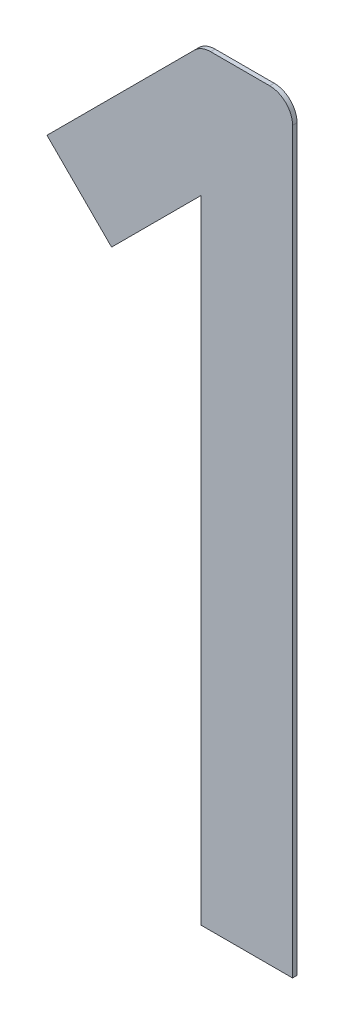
ISO-10303-21;
HEADER;
FILE_DESCRIPTION(('STEP AP214'),'2;1');
FILE_NAME('part.step','',(''),(''),'','','');
FILE_SCHEMA(('AUTOMOTIVE_DESIGN { 1 0 10303 214 1 1 1 1 }'));
ENDSEC;
DATA;
#1=APPLICATION_CONTEXT('core data for automotive mechanical design processes');
#2=APPLICATION_PROTOCOL_DEFINITION('international standard','automotive_design',2000,#1);
#3=PRODUCT_CONTEXT('',#1,'mechanical');
#4=PRODUCT('Part','Part','',(#3));
#5=PRODUCT_RELATED_PRODUCT_CATEGORY('part','',(#4));
#6=PRODUCT_DEFINITION_FORMATION('','',#4);
#7=PRODUCT_DEFINITION_CONTEXT('part definition',#1,'design');
#8=PRODUCT_DEFINITION('design','',#6,#7);
#9=PRODUCT_DEFINITION_SHAPE('','',#8);
#10=(LENGTH_UNIT() NAMED_UNIT(*) SI_UNIT(.MILLI.,.METRE.));
#11=(NAMED_UNIT(*) PLANE_ANGLE_UNIT() SI_UNIT($,.RADIAN.));
#12=(NAMED_UNIT(*) SI_UNIT($,.STERADIAN.) SOLID_ANGLE_UNIT());
#13=UNCERTAINTY_MEASURE_WITH_UNIT(LENGTH_MEASURE(1.E-05),#10,'distance_accuracy_value','');
#14=(GEOMETRIC_REPRESENTATION_CONTEXT(3) GLOBAL_UNCERTAINTY_ASSIGNED_CONTEXT((#13)) GLOBAL_UNIT_ASSIGNED_CONTEXT((#10,
#11,#12)) REPRESENTATION_CONTEXT('',''));
#15=CARTESIAN_POINT('',(0.,0.,0.));
#16=DIRECTION('',(0.,0.,1.));
#17=DIRECTION('',(1.,0.,0.));
#18=AXIS2_PLACEMENT_3D('',#15,#16,#17);
#19=CARTESIAN_POINT('',(-3.02146574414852,12.1135385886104,0.1));
#20=DIRECTION('',(-0.707106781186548,-0.707106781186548,0.));
#21=DIRECTION('',(0.707106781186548,-0.707106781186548,0.));
#22=AXIS2_PLACEMENT_3D('',#19,#20,#21);
#23=PLANE('',#22);
#24=DIRECTION('',(-0.707106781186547,0.707106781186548,0.));
#25=VECTOR('',#24,1.);
#26=CARTESIAN_POINT('',(-3.02146574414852,12.1135385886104,0.));
#27=LINE('',#26,#25);
#28=CARTESIAN_POINT('',(-3.02146574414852,12.1135385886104,0.));
#29=VERTEX_POINT('',#28);
#30=CARTESIAN_POINT('',(-4.46396357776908,13.5560364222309,0.));
#31=VERTEX_POINT('',#30);
#32=EDGE_CURVE('E109',#29,#31,#27,.T.);
#33=ORIENTED_EDGE('',*,*,#32,.F.);
#34=DIRECTION('',(0.,0.,-1.));
#35=VECTOR('',#34,1.);
#36=CARTESIAN_POINT('',(-3.02146574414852,12.1135385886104,0.1));
#37=LINE('',#36,#35);
#38=CARTESIAN_POINT('',(-3.02146574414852,12.1135385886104,0.1));
#39=VERTEX_POINT('',#38);
#40=EDGE_CURVE('E9',#39,#29,#37,.T.);
#41=ORIENTED_EDGE('',*,*,#40,.F.);
#42=DIRECTION('',(-0.707106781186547,0.707106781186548,0.));
#43=VECTOR('',#42,1.);
#44=CARTESIAN_POINT('',(-3.02146574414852,12.1135385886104,0.1));
#45=LINE('',#44,#43);
#46=CARTESIAN_POINT('',(-4.46396357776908,13.5560364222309,0.1));
#47=VERTEX_POINT('',#46);
#48=EDGE_CURVE('E110',#39,#47,#45,.T.);
#49=ORIENTED_EDGE('',*,*,#48,.T.);
#50=DIRECTION('',(0.,0.,-1.));
#51=VECTOR('',#50,1.);
#52=CARTESIAN_POINT('',(-4.46396357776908,13.5560364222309,0.1));
#53=LINE('',#52,#51);
#54=EDGE_CURVE('E17',#47,#31,#53,.T.);
#55=ORIENTED_EDGE('',*,*,#54,.T.);
#56=EDGE_LOOP('',(#33,#41,#49,#55));
#57=FACE_BOUND('',#56,.T.);
#58=ADVANCED_FACE('F14',(#57),#23,.T.);
#59=CARTESIAN_POINT('',(-3.02146574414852,12.1135385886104,0.1));
#60=DIRECTION('',(-0.707106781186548,0.707106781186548,0.));
#61=DIRECTION('',(-0.707106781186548,-0.707106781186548,0.));
#62=AXIS2_PLACEMENT_3D('',#59,#60,#61);
#63=PLANE('',#62);
#64=DIRECTION('',(0.707106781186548,0.707106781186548,0.));
#65=VECTOR('',#64,1.);
#66=CARTESIAN_POINT('',(-3.02146574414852,12.1135385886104,0.));
#67=LINE('',#66,#65);
#68=CARTESIAN_POINT('',(-1.02,14.1150043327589,0.));
#69=VERTEX_POINT('',#68);
#70=EDGE_CURVE('E130',#29,#69,#67,.T.);
#71=ORIENTED_EDGE('',*,*,#70,.T.);
#72=DIRECTION('',(0.,0.,-1.));
#73=VECTOR('',#72,1.);
#74=CARTESIAN_POINT('',(-1.02,14.1150043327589,0.1));
#75=LINE('',#74,#73);
#76=CARTESIAN_POINT('',(-1.02,14.1150043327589,0.1));
#77=VERTEX_POINT('',#76);
#78=EDGE_CURVE('E23',#77,#69,#75,.T.);
#79=ORIENTED_EDGE('',*,*,#78,.F.);
#80=DIRECTION('',(0.707106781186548,0.707106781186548,0.));
#81=VECTOR('',#80,1.);
#82=CARTESIAN_POINT('',(-3.02146574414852,12.1135385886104,0.1));
#83=LINE('',#82,#81);
#84=EDGE_CURVE('E45',#39,#77,#83,.T.);
#85=ORIENTED_EDGE('',*,*,#84,.F.);
#86=ORIENTED_EDGE('',*,*,#40,.T.);
#87=EDGE_LOOP('',(#71,#79,#85,#86));
#88=FACE_BOUND('',#87,.T.);
#89=ADVANCED_FACE('F222',(#88),#63,.F.);
#90=CARTESIAN_POINT('',(-1.02,0.,0.1));
#91=DIRECTION('',(-1.,0.,0.));
#92=DIRECTION('',(0.,-1.,0.));
#93=AXIS2_PLACEMENT_3D('',#90,#91,#92);
#94=PLANE('',#93);
#95=DIRECTION('',(0.,1.,0.));
#96=VECTOR('',#95,1.);
#97=CARTESIAN_POINT('',(-1.02,0.,0.));
#98=LINE('',#97,#96);
#99=CARTESIAN_POINT('',(-1.02,0.,0.));
#100=VERTEX_POINT('',#99);
#101=EDGE_CURVE('E317',#100,#69,#98,.T.);
#102=ORIENTED_EDGE('',*,*,#101,.F.);
#103=DIRECTION('',(0.,0.,-1.));
#104=VECTOR('',#103,1.);
#105=CARTESIAN_POINT('',(-1.02,0.,0.1));
#106=LINE('',#105,#104);
#107=CARTESIAN_POINT('',(-1.02,0.,0.1));
#108=VERTEX_POINT('',#107);
#109=EDGE_CURVE('E166',#108,#100,#106,.T.);
#110=ORIENTED_EDGE('',*,*,#109,.F.);
#111=DIRECTION('',(0.,1.,0.));
#112=VECTOR('',#111,1.);
#113=CARTESIAN_POINT('',(-1.02,0.,0.1));
#114=LINE('',#113,#112);
#115=EDGE_CURVE('E157',#108,#77,#114,.T.);
#116=ORIENTED_EDGE('',*,*,#115,.T.);
#117=ORIENTED_EDGE('',*,*,#78,.T.);
#118=EDGE_LOOP('',(#102,#110,#116,#117));
#119=FACE_BOUND('',#118,.T.);
#120=ADVANCED_FACE('F230',(#119),#94,.T.);
#121=CARTESIAN_POINT('',(-1.02,0.,0.1));
#122=DIRECTION('',(0.,1.,0.));
#123=DIRECTION('',(0.,0.,1.));
#124=AXIS2_PLACEMENT_3D('',#121,#122,#123);
#125=PLANE('',#124);
#126=DIRECTION('',(1.,0.,0.));
#127=VECTOR('',#126,1.);
#128=CARTESIAN_POINT('',(-1.02,0.,0.));
#129=LINE('',#128,#127);
#130=CARTESIAN_POINT('',(1.02,0.,0.));
#131=VERTEX_POINT('',#130);
#132=EDGE_CURVE('E316',#100,#131,#129,.T.);
#133=ORIENTED_EDGE('',*,*,#132,.T.);
#134=DIRECTION('',(0.,0.,-1.));
#135=VECTOR('',#134,1.);
#136=CARTESIAN_POINT('',(1.02,0.,0.1));
#137=LINE('',#136,#135);
#138=CARTESIAN_POINT('',(1.02,0.,0.1));
#139=VERTEX_POINT('',#138);
#140=EDGE_CURVE('E169',#139,#131,#137,.T.);
#141=ORIENTED_EDGE('',*,*,#140,.F.);
#142=DIRECTION('',(1.,0.,0.));
#143=VECTOR('',#142,1.);
#144=CARTESIAN_POINT('',(-1.02,0.,0.1));
#145=LINE('',#144,#143);
#146=EDGE_CURVE('E154',#108,#139,#145,.T.);
#147=ORIENTED_EDGE('',*,*,#146,.F.);
#148=ORIENTED_EDGE('',*,*,#109,.T.);
#149=EDGE_LOOP('',(#133,#141,#147,#148));
#150=FACE_BOUND('',#149,.T.);
#151=ADVANCED_FACE('F241',(#150),#125,.F.);
#152=CARTESIAN_POINT('',(1.02,0.,0.1));
#153=DIRECTION('',(-1.,0.,0.));
#154=DIRECTION('',(0.,-1.,0.));
#155=AXIS2_PLACEMENT_3D('',#152,#153,#154);
#156=PLANE('',#155);
#157=DIRECTION('',(0.,1.,0.));
#158=VECTOR('',#157,1.);
#159=CARTESIAN_POINT('',(1.02,0.,0.));
#160=LINE('',#159,#158);
#161=CARTESIAN_POINT('',(1.02,16.49,0.));
#162=VERTEX_POINT('',#161);
#163=EDGE_CURVE('E314',#131,#162,#160,.T.);
#164=ORIENTED_EDGE('',*,*,#163,.T.);
#165=DIRECTION('',(0.,0.,-1.));
#166=VECTOR('',#165,1.);
#167=CARTESIAN_POINT('',(1.02,16.49,0.1));
#168=LINE('',#167,#166);
#169=CARTESIAN_POINT('',(1.02,16.49,0.1));
#170=VERTEX_POINT('',#169);
#171=EDGE_CURVE('E173',#170,#162,#168,.T.);
#172=ORIENTED_EDGE('',*,*,#171,.F.);
#173=DIRECTION('',(0.,1.,0.));
#174=VECTOR('',#173,1.);
#175=CARTESIAN_POINT('',(1.02,0.,0.1));
#176=LINE('',#175,#174);
#177=EDGE_CURVE('E151',#139,#170,#176,.T.);
#178=ORIENTED_EDGE('',*,*,#177,.F.);
#179=ORIENTED_EDGE('',*,*,#140,.T.);
#180=EDGE_LOOP('',(#164,#172,#178,#179));
#181=FACE_BOUND('',#180,.T.);
#182=ADVANCED_FACE('F252',(#181),#156,.F.);
#183=CARTESIAN_POINT('',(0.51,16.49,0.1));
#184=DIRECTION('',(0.,0.,-1.));
#185=DIRECTION('',(-1.,0.,0.));
#186=AXIS2_PLACEMENT_3D('',#183,#184,#185);
#187=CYLINDRICAL_SURFACE('',#186,0.51);
#188=CARTESIAN_POINT('',(0.51,16.49,0.));
#189=DIRECTION('',(0.,0.,1.));
#190=DIRECTION('',(1.,0.,0.));
#191=AXIS2_PLACEMENT_3D('',#188,#189,#190);
#192=CIRCLE('',#191,0.51);
#193=CARTESIAN_POINT('',(0.51,17.,0.));
#194=VERTEX_POINT('',#193);
#195=EDGE_CURVE('E309',#162,#194,#192,.T.);
#196=ORIENTED_EDGE('',*,*,#195,.T.);
#197=DIRECTION('',(0.,0.,-1.));
#198=VECTOR('',#197,1.);
#199=CARTESIAN_POINT('',(0.51,17.,0.1));
#200=LINE('',#199,#198);
#201=CARTESIAN_POINT('',(0.51,17.,0.1));
#202=VERTEX_POINT('',#201);
#203=EDGE_CURVE('E177',#202,#194,#200,.T.);
#204=ORIENTED_EDGE('',*,*,#203,.F.);
#205=CARTESIAN_POINT('',(0.51,16.49,0.1));
#206=DIRECTION('',(0.,0.,1.));
#207=DIRECTION('',(1.,0.,0.));
#208=AXIS2_PLACEMENT_3D('',#205,#206,#207);
#209=CIRCLE('',#208,0.51);
#210=EDGE_CURVE('E148',#170,#202,#209,.T.);
#211=ORIENTED_EDGE('',*,*,#210,.F.);
#212=ORIENTED_EDGE('',*,*,#171,.T.);
#213=EDGE_LOOP('',(#196,#204,#211,#212));
#214=FACE_BOUND('',#213,.T.);
#215=ADVANCED_FACE('F263',(#214),#187,.T.);
#216=CARTESIAN_POINT('',(-0.808751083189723,17.,0.1));
#217=DIRECTION('',(0.,1.,0.));
#218=DIRECTION('',(0.,0.,1.));
#219=AXIS2_PLACEMENT_3D('',#216,#217,#218);
#220=PLANE('',#219);
#221=DIRECTION('',(1.,0.,0.));
#222=VECTOR('',#221,1.);
#223=CARTESIAN_POINT('',(-0.808751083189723,17.,0.));
#224=LINE('',#223,#222);
#225=CARTESIAN_POINT('',(-0.808751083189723,17.,0.));
#226=VERTEX_POINT('',#225);
#227=EDGE_CURVE('E305',#226,#194,#224,.T.);
#228=ORIENTED_EDGE('',*,*,#227,.F.);
#229=DIRECTION('',(0.,0.,-1.));
#230=VECTOR('',#229,1.);
#231=CARTESIAN_POINT('',(-0.808751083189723,17.,0.1));
#232=LINE('',#231,#230);
#233=CARTESIAN_POINT('',(-0.808751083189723,17.,0.1));
#234=VERTEX_POINT('',#233);
#235=EDGE_CURVE('E180',#234,#226,#232,.T.);
#236=ORIENTED_EDGE('',*,*,#235,.F.);
#237=DIRECTION('',(1.,0.,0.));
#238=VECTOR('',#237,1.);
#239=CARTESIAN_POINT('',(-0.808751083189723,17.,0.1));
#240=LINE('',#239,#238);
#241=EDGE_CURVE('E144',#234,#202,#240,.T.);
#242=ORIENTED_EDGE('',*,*,#241,.T.);
#243=ORIENTED_EDGE('',*,*,#203,.T.);
#244=EDGE_LOOP('',(#228,#236,#242,#243));
#245=FACE_BOUND('',#244,.T.);
#246=ADVANCED_FACE('F274',(#245),#220,.T.);
#247=CARTESIAN_POINT('',(-0.808751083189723,16.49,0.1));
#248=DIRECTION('',(0.,0.,-1.));
#249=DIRECTION('',(-1.,0.,0.));
#250=AXIS2_PLACEMENT_3D('',#247,#248,#249);
#251=CYLINDRICAL_SURFACE('',#250,0.51);
#252=CARTESIAN_POINT('',(-0.808751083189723,16.49,0.));
#253=DIRECTION('',(0.,0.,1.));
#254=DIRECTION('',(1.,0.,0.));
#255=AXIS2_PLACEMENT_3D('',#252,#253,#254);
#256=CIRCLE('',#255,0.51);
#257=CARTESIAN_POINT('',(-1.16937554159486,16.8506244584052,0.));
#258=VERTEX_POINT('',#257);
#259=EDGE_CURVE('E124',#226,#258,#256,.T.);
#260=ORIENTED_EDGE('',*,*,#259,.T.);
#261=DIRECTION('',(0.,0.,-1.));
#262=VECTOR('',#261,1.);
#263=CARTESIAN_POINT('',(-1.16937554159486,16.8506244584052,0.1));
#264=LINE('',#263,#262);
#265=CARTESIAN_POINT('',(-1.16937554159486,16.8506244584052,0.1));
#266=VERTEX_POINT('',#265);
#267=EDGE_CURVE('E115',#266,#258,#264,.T.);
#268=ORIENTED_EDGE('',*,*,#267,.F.);
#269=CARTESIAN_POINT('',(-0.808751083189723,16.49,0.1));
#270=DIRECTION('',(0.,0.,1.));
#271=DIRECTION('',(1.,0.,0.));
#272=AXIS2_PLACEMENT_3D('',#269,#270,#271);
#273=CIRCLE('',#272,0.51);
#274=EDGE_CURVE('E141',#234,#266,#273,.T.);
#275=ORIENTED_EDGE('',*,*,#274,.F.);
#276=ORIENTED_EDGE('',*,*,#235,.T.);
#277=EDGE_LOOP('',(#260,#268,#275,#276));
#278=FACE_BOUND('',#277,.T.);
#279=ADVANCED_FACE('F193',(#278),#251,.T.);
#280=CARTESIAN_POINT('',(-4.46396357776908,13.5560364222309,0.1));
#281=DIRECTION('',(-0.707106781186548,0.707106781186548,0.));
#282=DIRECTION('',(-0.707106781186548,-0.707106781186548,0.));
#283=AXIS2_PLACEMENT_3D('',#280,#281,#282);
#284=PLANE('',#283);
#285=DIRECTION('',(0.707106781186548,0.707106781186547,0.));
#286=VECTOR('',#285,1.);
#287=CARTESIAN_POINT('',(-4.46396357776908,13.5560364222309,0.));
#288=LINE('',#287,#286);
#289=EDGE_CURVE('E117',#31,#258,#288,.T.);
#290=ORIENTED_EDGE('',*,*,#289,.F.);
#291=ORIENTED_EDGE('',*,*,#54,.F.);
#292=DIRECTION('',(0.707106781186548,0.707106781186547,0.));
#293=VECTOR('',#292,1.);
#294=CARTESIAN_POINT('',(-4.46396357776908,13.5560364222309,0.1));
#295=LINE('',#294,#293);
#296=EDGE_CURVE('E138',#47,#266,#295,.T.);
#297=ORIENTED_EDGE('',*,*,#296,.T.);
#298=ORIENTED_EDGE('',*,*,#267,.T.);
#299=EDGE_LOOP('',(#290,#291,#297,#298));
#300=FACE_BOUND('',#299,.T.);
#301=ADVANCED_FACE('F118',(#300),#284,.T.);
#302=CARTESIAN_POINT('',(-0.808751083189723,16.49,0.1));
#303=DIRECTION('',(0.,0.,1.));
#304=DIRECTION('',(1.,0.,0.));
#305=AXIS2_PLACEMENT_3D('',#302,#303,#304);
#306=PLANE('',#305);
#307=ORIENTED_EDGE('',*,*,#48,.F.);
#308=ORIENTED_EDGE('',*,*,#84,.T.);
#309=ORIENTED_EDGE('',*,*,#115,.F.);
#310=ORIENTED_EDGE('',*,*,#146,.T.);
#311=ORIENTED_EDGE('',*,*,#177,.T.);
#312=ORIENTED_EDGE('',*,*,#210,.T.);
#313=ORIENTED_EDGE('',*,*,#241,.F.);
#314=ORIENTED_EDGE('',*,*,#274,.T.);
#315=ORIENTED_EDGE('',*,*,#296,.F.);
#316=EDGE_LOOP('',(#307,#308,#309,#310,#311,#312,#313,#314,#315));
#317=FACE_BOUND('',#316,.T.);
#318=ADVANCED_FACE('F192',(#317),#306,.T.);
#319=CARTESIAN_POINT('',(-0.808751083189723,16.49,0.));
#320=DIRECTION('',(0.,0.,1.));
#321=DIRECTION('',(1.,0.,0.));
#322=AXIS2_PLACEMENT_3D('',#319,#320,#321);
#323=PLANE('',#322);
#324=ORIENTED_EDGE('',*,*,#32,.T.);
#325=ORIENTED_EDGE('',*,*,#289,.T.);
#326=ORIENTED_EDGE('',*,*,#259,.F.);
#327=ORIENTED_EDGE('',*,*,#227,.T.);
#328=ORIENTED_EDGE('',*,*,#195,.F.);
#329=ORIENTED_EDGE('',*,*,#163,.F.);
#330=ORIENTED_EDGE('',*,*,#132,.F.);
#331=ORIENTED_EDGE('',*,*,#101,.T.);
#332=ORIENTED_EDGE('',*,*,#70,.F.);
#333=EDGE_LOOP('',(#324,#325,#326,#327,#328,#329,#330,#331,#332));
#334=FACE_BOUND('',#333,.T.);
#335=ADVANCED_FACE('F127',(#334),#323,.F.);
#336=CLOSED_SHELL('',(#58,#89,#120,#151,#182,#215,#246,#279,#301,#318,#335));
#337=MANIFOLD_SOLID_BREP('B1',#336);
#338=ADVANCED_BREP_SHAPE_REPRESENTATION('',(#18,#337),#14);
#339=SHAPE_DEFINITION_REPRESENTATION(#9,#338);
ENDSEC;
END-ISO-10303-21;
